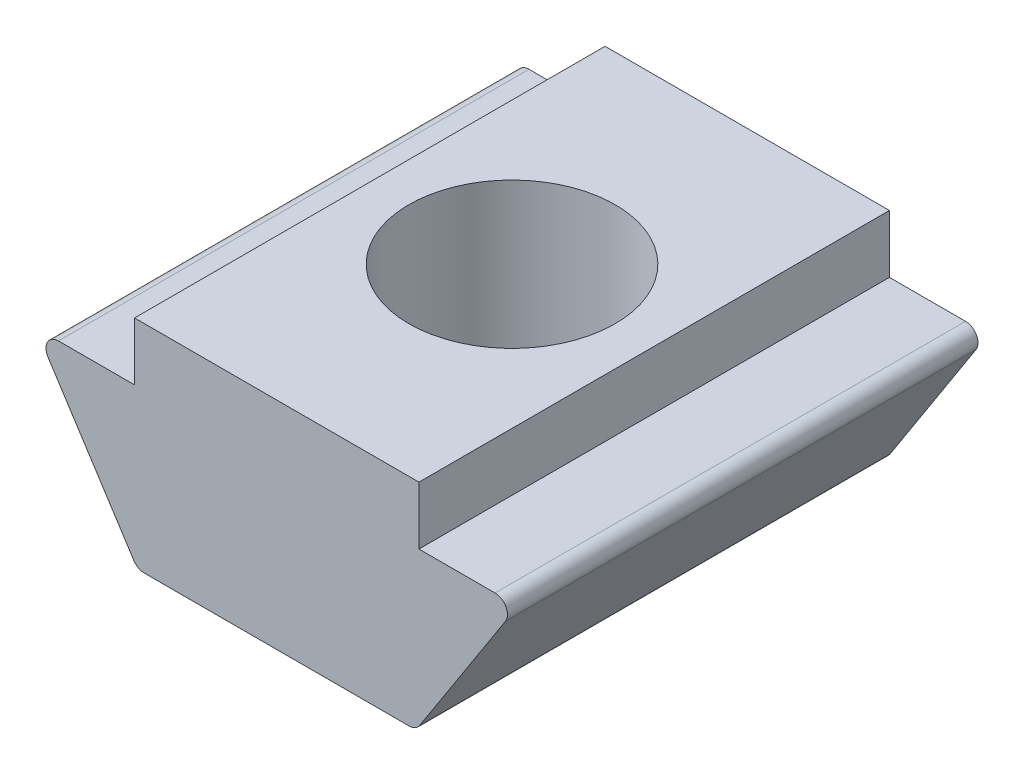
ISO-10303-21;
HEADER;
FILE_DESCRIPTION(('STEP AP214'),'2;1');
FILE_NAME('part.step','',(''),(''),'','','');
FILE_SCHEMA(('AUTOMOTIVE_DESIGN { 1 0 10303 214 1 1 1 1 }'));
ENDSEC;
DATA;
#1=APPLICATION_CONTEXT('core data for automotive mechanical design processes');
#2=APPLICATION_PROTOCOL_DEFINITION('international standard','automotive_design',2000,#1);
#3=PRODUCT_CONTEXT('',#1,'mechanical');
#4=PRODUCT('Part','Part','',(#3));
#5=PRODUCT_RELATED_PRODUCT_CATEGORY('part','',(#4));
#6=PRODUCT_DEFINITION_FORMATION('','',#4);
#7=PRODUCT_DEFINITION_CONTEXT('part definition',#1,'design');
#8=PRODUCT_DEFINITION('design','',#6,#7);
#9=PRODUCT_DEFINITION_SHAPE('','',#8);
#10=(LENGTH_UNIT() NAMED_UNIT(*) SI_UNIT(.MILLI.,.METRE.));
#11=(NAMED_UNIT(*) PLANE_ANGLE_UNIT() SI_UNIT($,.RADIAN.));
#12=(NAMED_UNIT(*) SI_UNIT($,.STERADIAN.) SOLID_ANGLE_UNIT());
#13=UNCERTAINTY_MEASURE_WITH_UNIT(LENGTH_MEASURE(1.E-05),#10,'distance_accuracy_value','');
#14=(GEOMETRIC_REPRESENTATION_CONTEXT(3) GLOBAL_UNCERTAINTY_ASSIGNED_CONTEXT((#13)) GLOBAL_UNIT_ASSIGNED_CONTEXT((#10,
#11,#12)) REPRESENTATION_CONTEXT('',''));
#15=CARTESIAN_POINT('',(0.,0.,0.));
#16=DIRECTION('',(0.,0.,1.));
#17=DIRECTION('',(1.,0.,0.));
#18=AXIS2_PLACEMENT_3D('',#15,#16,#17);
#19=CARTESIAN_POINT('',(-2.895,0.,9.58));
#20=DIRECTION('',(0.,-1.,0.));
#21=DIRECTION('',(0.,0.,-1.));
#22=AXIS2_PLACEMENT_3D('',#19,#20,#21);
#23=PLANE('',#22);
#24=DIRECTION('',(-1.,0.,0.));
#25=VECTOR('',#24,1.);
#26=CARTESIAN_POINT('',(-2.895,0.,0.));
#27=LINE('',#26,#25);
#28=CARTESIAN_POINT('',(2.895,0.,0.));
#29=VERTEX_POINT('',#28);
#30=CARTESIAN_POINT('',(-2.895,0.,0.));
#31=VERTEX_POINT('',#30);
#32=EDGE_CURVE('E226',#29,#31,#27,.T.);
#33=ORIENTED_EDGE('',*,*,#32,.T.);
#34=DIRECTION('',(0.,0.,-1.));
#35=VECTOR('',#34,1.);
#36=CARTESIAN_POINT('',(-2.895,0.,9.58));
#37=LINE('',#36,#35);
#38=CARTESIAN_POINT('',(-2.895,0.,9.58));
#39=VERTEX_POINT('',#38);
#40=EDGE_CURVE('E134',#39,#31,#37,.T.);
#41=ORIENTED_EDGE('',*,*,#40,.F.);
#42=DIRECTION('',(-1.,0.,0.));
#43=VECTOR('',#42,1.);
#44=CARTESIAN_POINT('',(-2.895,0.,9.58));
#45=LINE('',#44,#43);
#46=CARTESIAN_POINT('',(2.895,0.,9.58));
#47=VERTEX_POINT('',#46);
#48=EDGE_CURVE('E127',#47,#39,#45,.T.);
#49=ORIENTED_EDGE('',*,*,#48,.F.);
#50=DIRECTION('',(0.,0.,-1.));
#51=VECTOR('',#50,1.);
#52=CARTESIAN_POINT('',(2.895,0.,9.58));
#53=LINE('',#52,#51);
#54=EDGE_CURVE('E131',#47,#29,#53,.T.);
#55=ORIENTED_EDGE('',*,*,#54,.T.);
#56=EDGE_LOOP('',(#33,#41,#49,#55));
#57=FACE_BOUND('',#56,.T.);
#58=CARTESIAN_POINT('',(0.,0.,4.79));
#59=DIRECTION('',(0.,1.,0.));
#60=DIRECTION('',(0.,0.,1.));
#61=AXIS2_PLACEMENT_3D('',#58,#59,#60);
#62=CIRCLE('',#61,2.09999999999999);
#63=CARTESIAN_POINT('',(0.,0.,6.88999999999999));
#64=VERTEX_POINT('',#63);
#65=EDGE_CURVE('E238',#64,#64,#62,.T.);
#66=ORIENTED_EDGE('',*,*,#65,.F.);
#67=EDGE_LOOP('',(#66));
#68=FACE_BOUND('',#67,.T.);
#69=ADVANCED_FACE('F35',(#57,#68),#23,.F.);
#70=CARTESIAN_POINT('',(2.895,0.,9.58));
#71=DIRECTION('',(-1.,0.,0.));
#72=DIRECTION('',(0.,-1.,0.));
#73=AXIS2_PLACEMENT_3D('',#70,#71,#72);
#74=PLANE('',#73);
#75=DIRECTION('',(0.,1.,0.));
#76=VECTOR('',#75,1.);
#77=CARTESIAN_POINT('',(2.895,0.,0.));
#78=LINE('',#77,#76);
#79=CARTESIAN_POINT('',(2.895,-1.18,0.));
#80=VERTEX_POINT('',#79);
#81=EDGE_CURVE('E150',#80,#29,#78,.T.);
#82=ORIENTED_EDGE('',*,*,#81,.T.);
#83=ORIENTED_EDGE('',*,*,#54,.F.);
#84=DIRECTION('',(0.,1.,0.));
#85=VECTOR('',#84,1.);
#86=CARTESIAN_POINT('',(2.895,0.,9.58));
#87=LINE('',#86,#85);
#88=CARTESIAN_POINT('',(2.895,-1.18,9.58));
#89=VERTEX_POINT('',#88);
#90=EDGE_CURVE('E137',#89,#47,#87,.T.);
#91=ORIENTED_EDGE('',*,*,#90,.F.);
#92=DIRECTION('',(0.,0.,-1.));
#93=VECTOR('',#92,1.);
#94=CARTESIAN_POINT('',(2.895,-1.18,9.58));
#95=LINE('',#94,#93);
#96=EDGE_CURVE('E223',#89,#80,#95,.T.);
#97=ORIENTED_EDGE('',*,*,#96,.T.);
#98=EDGE_LOOP('',(#82,#83,#91,#97));
#99=FACE_BOUND('',#98,.T.);
#100=ADVANCED_FACE('F148',(#99),#74,.F.);
#101=CARTESIAN_POINT('',(-2.895,0.,9.58));
#102=DIRECTION('',(1.,0.,0.));
#103=DIRECTION('',(0.,1.,0.));
#104=AXIS2_PLACEMENT_3D('',#101,#102,#103);
#105=PLANE('',#104);
#106=DIRECTION('',(0.,-1.,0.));
#107=VECTOR('',#106,1.);
#108=CARTESIAN_POINT('',(-2.895,0.,0.));
#109=LINE('',#108,#107);
#110=CARTESIAN_POINT('',(-2.895,-1.18,0.));
#111=VERTEX_POINT('',#110);
#112=EDGE_CURVE('E217',#31,#111,#109,.T.);
#113=ORIENTED_EDGE('',*,*,#112,.T.);
#114=DIRECTION('',(0.,0.,-1.));
#115=VECTOR('',#114,1.);
#116=CARTESIAN_POINT('',(-2.895,-1.18,9.58));
#117=LINE('',#116,#115);
#118=CARTESIAN_POINT('',(-2.895,-1.18,9.58));
#119=VERTEX_POINT('',#118);
#120=EDGE_CURVE('E155',#119,#111,#117,.T.);
#121=ORIENTED_EDGE('',*,*,#120,.F.);
#122=DIRECTION('',(0.,-1.,0.));
#123=VECTOR('',#122,1.);
#124=CARTESIAN_POINT('',(-2.895,0.,9.58));
#125=LINE('',#124,#123);
#126=EDGE_CURVE('E136',#39,#119,#125,.T.);
#127=ORIENTED_EDGE('',*,*,#126,.F.);
#128=ORIENTED_EDGE('',*,*,#40,.T.);
#129=EDGE_LOOP('',(#113,#121,#127,#128));
#130=FACE_BOUND('',#129,.T.);
#131=ADVANCED_FACE('F261',(#130),#105,.F.);
#132=CARTESIAN_POINT('',(-2.895,-1.18,9.58));
#133=DIRECTION('',(0.,-1.,0.));
#134=DIRECTION('',(0.,0.,-1.));
#135=AXIS2_PLACEMENT_3D('',#132,#133,#134);
#136=PLANE('',#135);
#137=DIRECTION('',(-1.,0.,0.));
#138=VECTOR('',#137,1.);
#139=CARTESIAN_POINT('',(-2.895,-1.18,0.));
#140=LINE('',#139,#138);
#141=CARTESIAN_POINT('',(-4.44414909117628,-1.18,0.));
#142=VERTEX_POINT('',#141);
#143=EDGE_CURVE('E194',#111,#142,#140,.T.);
#144=ORIENTED_EDGE('',*,*,#143,.T.);
#145=DIRECTION('',(0.,0.,-1.));
#146=VECTOR('',#145,1.);
#147=CARTESIAN_POINT('',(-4.44414909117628,-1.18,9.58));
#148=LINE('',#147,#146);
#149=CARTESIAN_POINT('',(-4.44414909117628,-1.18,9.58));
#150=VERTEX_POINT('',#149);
#151=EDGE_CURVE('E44',#142,#150,#148,.F.);
#152=ORIENTED_EDGE('',*,*,#151,.T.);
#153=DIRECTION('',(-1.,0.,0.));
#154=VECTOR('',#153,1.);
#155=CARTESIAN_POINT('',(-2.895,-1.18,9.58));
#156=LINE('',#155,#154);
#157=EDGE_CURVE('E192',#119,#150,#156,.T.);
#158=ORIENTED_EDGE('',*,*,#157,.F.);
#159=ORIENTED_EDGE('',*,*,#120,.T.);
#160=EDGE_LOOP('',(#144,#152,#158,#159));
#161=FACE_BOUND('',#160,.T.);
#162=ADVANCED_FACE('F190',(#161),#136,.F.);
#163=CARTESIAN_POINT('',(-4.91,-1.18,9.58));
#164=DIRECTION('',(0.840584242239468,0.541680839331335,0.));
#165=DIRECTION('',(-0.541680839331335,0.840584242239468,0.));
#166=AXIS2_PLACEMENT_3D('',#163,#164,#165);
#167=PLANE('',#166);
#168=DIRECTION('',(0.541680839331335,-0.840584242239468,0.));
#169=VECTOR('',#168,1.);
#170=CARTESIAN_POINT('',(-4.91,-1.18,0.));
#171=LINE('',#170,#169);
#172=CARTESIAN_POINT('',(-4.6576574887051,-1.57158693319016,0.));
#173=VERTEX_POINT('',#172);
#174=CARTESIAN_POINT('',(-2.9100177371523,-4.28358693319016,0.));
#175=VERTEX_POINT('',#174);
#176=EDGE_CURVE('E207',#173,#175,#171,.T.);
#177=ORIENTED_EDGE('',*,*,#176,.T.);
#178=DIRECTION('',(0.,0.,-1.));
#179=VECTOR('',#178,1.);
#180=CARTESIAN_POINT('',(-2.9100177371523,-4.28358693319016,9.58));
#181=LINE('',#180,#179);
#182=CARTESIAN_POINT('',(-2.9100177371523,-4.28358693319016,9.58));
#183=VERTEX_POINT('',#182);
#184=EDGE_CURVE('E172',#175,#183,#181,.F.);
#185=ORIENTED_EDGE('',*,*,#184,.T.);
#186=DIRECTION('',(0.541680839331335,-0.840584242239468,0.));
#187=VECTOR('',#186,1.);
#188=CARTESIAN_POINT('',(-4.91,-1.18,9.58));
#189=LINE('',#188,#187);
#190=CARTESIAN_POINT('',(-4.6576574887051,-1.57158693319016,9.58));
#191=VERTEX_POINT('',#190);
#192=EDGE_CURVE('E199',#191,#183,#189,.T.);
#193=ORIENTED_EDGE('',*,*,#192,.F.);
#194=DIRECTION('',(0.,0.,-1.));
#195=VECTOR('',#194,1.);
#196=CARTESIAN_POINT('',(-4.6576574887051,-1.57158693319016,9.58));
#197=LINE('',#196,#195);
#198=EDGE_CURVE('E169',#191,#173,#197,.T.);
#199=ORIENTED_EDGE('',*,*,#198,.T.);
#200=EDGE_LOOP('',(#177,#185,#193,#199));
#201=FACE_BOUND('',#200,.T.);
#202=ADVANCED_FACE('F206',(#201),#167,.F.);
#203=CARTESIAN_POINT('',(-2.835,-4.4,9.58));
#204=DIRECTION('',(0.,1.,0.));
#205=DIRECTION('',(0.,0.,1.));
#206=AXIS2_PLACEMENT_3D('',#203,#204,#205);
#207=PLANE('',#206);
#208=CARTESIAN_POINT('',(0.,-4.4,4.79));
#209=DIRECTION('',(0.,1.,0.));
#210=DIRECTION('',(0.,0.,1.));
#211=AXIS2_PLACEMENT_3D('',#208,#209,#210);
#212=CIRCLE('',#211,2.09999999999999);
#213=CARTESIAN_POINT('',(0.,-4.4,6.88999999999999));
#214=VERTEX_POINT('',#213);
#215=EDGE_CURVE('E39',#214,#214,#212,.T.);
#216=ORIENTED_EDGE('',*,*,#215,.T.);
#217=EDGE_LOOP('',(#216));
#218=FACE_BOUND('',#217,.T.);
#219=DIRECTION('',(1.,0.,0.));
#220=VECTOR('',#219,1.);
#221=CARTESIAN_POINT('',(-2.835,-4.4,9.58));
#222=LINE('',#221,#220);
#223=CARTESIAN_POINT('',(-2.69650933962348,-4.4,9.58));
#224=VERTEX_POINT('',#223);
#225=CARTESIAN_POINT('',(2.69650933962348,-4.4,9.58));
#226=VERTEX_POINT('',#225);
#227=EDGE_CURVE('E233',#224,#226,#222,.T.);
#228=ORIENTED_EDGE('',*,*,#227,.F.);
#229=DIRECTION('',(0.,0.,-1.));
#230=VECTOR('',#229,1.);
#231=CARTESIAN_POINT('',(-2.69650933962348,-4.4,9.58));
#232=LINE('',#231,#230);
#233=CARTESIAN_POINT('',(-2.69650933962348,-4.4,0.));
#234=VERTEX_POINT('',#233);
#235=EDGE_CURVE('E153',#224,#234,#232,.T.);
#236=ORIENTED_EDGE('',*,*,#235,.T.);
#237=DIRECTION('',(1.,0.,0.));
#238=VECTOR('',#237,1.);
#239=CARTESIAN_POINT('',(-2.835,-4.4,0.));
#240=LINE('',#239,#238);
#241=CARTESIAN_POINT('',(2.69650933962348,-4.4,0.));
#242=VERTEX_POINT('',#241);
#243=EDGE_CURVE('E212',#234,#242,#240,.T.);
#244=ORIENTED_EDGE('',*,*,#243,.T.);
#245=DIRECTION('',(0.,0.,-1.));
#246=VECTOR('',#245,1.);
#247=CARTESIAN_POINT('',(2.69650933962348,-4.4,9.58));
#248=LINE('',#247,#246);
#249=EDGE_CURVE('E151',#242,#226,#248,.F.);
#250=ORIENTED_EDGE('',*,*,#249,.T.);
#251=EDGE_LOOP('',(#228,#236,#244,#250));
#252=FACE_BOUND('',#251,.T.);
#253=ADVANCED_FACE('F245',(#218,#252),#207,.F.);
#254=CARTESIAN_POINT('',(4.91,-1.18,9.58));
#255=DIRECTION('',(-0.840584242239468,0.541680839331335,0.));
#256=DIRECTION('',(-0.541680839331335,-0.840584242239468,0.));
#257=AXIS2_PLACEMENT_3D('',#254,#255,#256);
#258=PLANE('',#257);
#259=DIRECTION('',(0.541680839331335,0.840584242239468,0.));
#260=VECTOR('',#259,1.);
#261=CARTESIAN_POINT('',(4.91,-1.18,9.58));
#262=LINE('',#261,#260);
#263=CARTESIAN_POINT('',(2.9100177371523,-4.28358693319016,9.58));
#264=VERTEX_POINT('',#263);
#265=CARTESIAN_POINT('',(4.6576574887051,-1.57158693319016,9.58));
#266=VERTEX_POINT('',#265);
#267=EDGE_CURVE('E231',#264,#266,#262,.T.);
#268=ORIENTED_EDGE('',*,*,#267,.F.);
#269=DIRECTION('',(0.,0.,-1.));
#270=VECTOR('',#269,1.);
#271=CARTESIAN_POINT('',(2.9100177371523,-4.28358693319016,9.58));
#272=LINE('',#271,#270);
#273=CARTESIAN_POINT('',(2.9100177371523,-4.28358693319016,0.));
#274=VERTEX_POINT('',#273);
#275=EDGE_CURVE('E182',#264,#274,#272,.T.);
#276=ORIENTED_EDGE('',*,*,#275,.T.);
#277=DIRECTION('',(0.541680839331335,0.840584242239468,0.));
#278=VECTOR('',#277,1.);
#279=CARTESIAN_POINT('',(4.91,-1.18,0.));
#280=LINE('',#279,#278);
#281=CARTESIAN_POINT('',(4.6576574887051,-1.57158693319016,0.));
#282=VERTEX_POINT('',#281);
#283=EDGE_CURVE('E215',#274,#282,#280,.T.);
#284=ORIENTED_EDGE('',*,*,#283,.T.);
#285=DIRECTION('',(0.,0.,-1.));
#286=VECTOR('',#285,1.);
#287=CARTESIAN_POINT('',(4.6576574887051,-1.57158693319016,9.58));
#288=LINE('',#287,#286);
#289=EDGE_CURVE('E59',#282,#266,#288,.F.);
#290=ORIENTED_EDGE('',*,*,#289,.T.);
#291=EDGE_LOOP('',(#268,#276,#284,#290));
#292=FACE_BOUND('',#291,.T.);
#293=ADVANCED_FACE('F296',(#292),#258,.F.);
#294=CARTESIAN_POINT('',(2.895,-1.18,9.58));
#295=DIRECTION('',(0.,-1.,0.));
#296=DIRECTION('',(0.,0.,-1.));
#297=AXIS2_PLACEMENT_3D('',#294,#295,#296);
#298=PLANE('',#297);
#299=DIRECTION('',(-1.,0.,0.));
#300=VECTOR('',#299,1.);
#301=CARTESIAN_POINT('',(2.895,-1.18,9.58));
#302=LINE('',#301,#300);
#303=CARTESIAN_POINT('',(4.44414909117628,-1.18,9.58));
#304=VERTEX_POINT('',#303);
#305=EDGE_CURVE('E142',#304,#89,#302,.T.);
#306=ORIENTED_EDGE('',*,*,#305,.F.);
#307=DIRECTION('',(0.,0.,-1.));
#308=VECTOR('',#307,1.);
#309=CARTESIAN_POINT('',(4.44414909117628,-1.18,9.58));
#310=LINE('',#309,#308);
#311=CARTESIAN_POINT('',(4.44414909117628,-1.18,0.));
#312=VERTEX_POINT('',#311);
#313=EDGE_CURVE('E11',#304,#312,#310,.T.);
#314=ORIENTED_EDGE('',*,*,#313,.T.);
#315=DIRECTION('',(-1.,0.,0.));
#316=VECTOR('',#315,1.);
#317=CARTESIAN_POINT('',(2.895,-1.18,0.));
#318=LINE('',#317,#316);
#319=EDGE_CURVE('E146',#312,#80,#318,.T.);
#320=ORIENTED_EDGE('',*,*,#319,.T.);
#321=ORIENTED_EDGE('',*,*,#96,.F.);
#322=EDGE_LOOP('',(#306,#314,#320,#321));
#323=FACE_BOUND('',#322,.T.);
#324=ADVANCED_FACE('F325',(#323),#298,.F.);
#325=CARTESIAN_POINT('',(0.,0.,9.58));
#326=DIRECTION('',(0.,0.,1.));
#327=DIRECTION('',(1.,0.,0.));
#328=AXIS2_PLACEMENT_3D('',#325,#326,#327);
#329=PLANE('',#328);
#330=ORIENTED_EDGE('',*,*,#192,.T.);
#331=CARTESIAN_POINT('',(-2.69650933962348,-4.146,9.58));
#332=DIRECTION('',(0.,0.,1.));
#333=DIRECTION('',(1.,0.,0.));
#334=AXIS2_PLACEMENT_3D('',#331,#332,#333);
#335=CIRCLE('',#334,0.254);
#336=EDGE_CURVE('E179',#183,#224,#335,.T.);
#337=ORIENTED_EDGE('',*,*,#336,.T.);
#338=ORIENTED_EDGE('',*,*,#227,.T.);
#339=CARTESIAN_POINT('',(2.69650933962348,-4.146,9.58));
#340=DIRECTION('',(0.,0.,1.));
#341=DIRECTION('',(1.,0.,0.));
#342=AXIS2_PLACEMENT_3D('',#339,#340,#341);
#343=CIRCLE('',#342,0.254);
#344=EDGE_CURVE('E177',#226,#264,#343,.T.);
#345=ORIENTED_EDGE('',*,*,#344,.T.);
#346=ORIENTED_EDGE('',*,*,#267,.T.);
#347=CARTESIAN_POINT('',(4.44414909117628,-1.434,9.58));
#348=DIRECTION('',(0.,0.,1.));
#349=DIRECTION('',(1.,0.,0.));
#350=AXIS2_PLACEMENT_3D('',#347,#348,#349);
#351=CIRCLE('',#350,0.254);
#352=EDGE_CURVE('E51',#266,#304,#351,.T.);
#353=ORIENTED_EDGE('',*,*,#352,.T.);
#354=ORIENTED_EDGE('',*,*,#305,.T.);
#355=ORIENTED_EDGE('',*,*,#90,.T.);
#356=ORIENTED_EDGE('',*,*,#48,.T.);
#357=ORIENTED_EDGE('',*,*,#126,.T.);
#358=ORIENTED_EDGE('',*,*,#157,.T.);
#359=CARTESIAN_POINT('',(-4.44414909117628,-1.434,9.58));
#360=DIRECTION('',(0.,0.,1.));
#361=DIRECTION('',(1.,0.,0.));
#362=AXIS2_PLACEMENT_3D('',#359,#360,#361);
#363=CIRCLE('',#362,0.254);
#364=EDGE_CURVE('E175',#150,#191,#363,.T.);
#365=ORIENTED_EDGE('',*,*,#364,.T.);
#366=EDGE_LOOP('',(#330,#337,#338,#345,#346,#353,#354,#355,#356,#357,#358,#365));
#367=FACE_BOUND('',#366,.T.);
#368=ADVANCED_FACE('F141',(#367),#329,.T.);
#369=CARTESIAN_POINT('',(0.,0.,0.));
#370=DIRECTION('',(0.,0.,1.));
#371=DIRECTION('',(1.,0.,0.));
#372=AXIS2_PLACEMENT_3D('',#369,#370,#371);
#373=PLANE('',#372);
#374=ORIENTED_EDGE('',*,*,#243,.F.);
#375=CARTESIAN_POINT('',(-2.69650933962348,-4.146,0.));
#376=DIRECTION('',(0.,0.,1.));
#377=DIRECTION('',(1.,0.,0.));
#378=AXIS2_PLACEMENT_3D('',#375,#376,#377);
#379=CIRCLE('',#378,0.254);
#380=EDGE_CURVE('E167',#234,#175,#379,.F.);
#381=ORIENTED_EDGE('',*,*,#380,.T.);
#382=ORIENTED_EDGE('',*,*,#176,.F.);
#383=CARTESIAN_POINT('',(-4.44414909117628,-1.434,0.));
#384=DIRECTION('',(0.,0.,1.));
#385=DIRECTION('',(1.,0.,0.));
#386=AXIS2_PLACEMENT_3D('',#383,#384,#385);
#387=CIRCLE('',#386,0.254);
#388=EDGE_CURVE('E163',#173,#142,#387,.F.);
#389=ORIENTED_EDGE('',*,*,#388,.T.);
#390=ORIENTED_EDGE('',*,*,#143,.F.);
#391=ORIENTED_EDGE('',*,*,#112,.F.);
#392=ORIENTED_EDGE('',*,*,#32,.F.);
#393=ORIENTED_EDGE('',*,*,#81,.F.);
#394=ORIENTED_EDGE('',*,*,#319,.F.);
#395=CARTESIAN_POINT('',(4.44414909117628,-1.434,0.));
#396=DIRECTION('',(0.,0.,1.));
#397=DIRECTION('',(1.,0.,0.));
#398=AXIS2_PLACEMENT_3D('',#395,#396,#397);
#399=CIRCLE('',#398,0.254);
#400=EDGE_CURVE('E161',#312,#282,#399,.F.);
#401=ORIENTED_EDGE('',*,*,#400,.T.);
#402=ORIENTED_EDGE('',*,*,#283,.F.);
#403=CARTESIAN_POINT('',(2.69650933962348,-4.146,0.));
#404=DIRECTION('',(0.,0.,1.));
#405=DIRECTION('',(1.,0.,0.));
#406=AXIS2_PLACEMENT_3D('',#403,#404,#405);
#407=CIRCLE('',#406,0.254);
#408=EDGE_CURVE('E165',#274,#242,#407,.F.);
#409=ORIENTED_EDGE('',*,*,#408,.T.);
#410=EDGE_LOOP('',(#374,#381,#382,#389,#390,#391,#392,#393,#394,#401,#402,#409));
#411=FACE_BOUND('',#410,.T.);
#412=ADVANCED_FACE('F211',(#411),#373,.F.);
#413=CARTESIAN_POINT('',(-2.69650933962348,-4.146,9.58));
#414=DIRECTION('',(0.,0.,-1.));
#415=DIRECTION('',(-1.,0.,0.));
#416=AXIS2_PLACEMENT_3D('',#413,#414,#415);
#417=CYLINDRICAL_SURFACE('',#416,0.254);
#418=ORIENTED_EDGE('',*,*,#336,.F.);
#419=ORIENTED_EDGE('',*,*,#184,.F.);
#420=ORIENTED_EDGE('',*,*,#380,.F.);
#421=ORIENTED_EDGE('',*,*,#235,.F.);
#422=EDGE_LOOP('',(#418,#419,#420,#421));
#423=FACE_BOUND('',#422,.T.);
#424=ADVANCED_FACE('F266',(#423),#417,.T.);
#425=CARTESIAN_POINT('',(2.69650933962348,-4.146,9.58));
#426=DIRECTION('',(0.,0.,-1.));
#427=DIRECTION('',(-1.,0.,0.));
#428=AXIS2_PLACEMENT_3D('',#425,#426,#427);
#429=CYLINDRICAL_SURFACE('',#428,0.254);
#430=ORIENTED_EDGE('',*,*,#344,.F.);
#431=ORIENTED_EDGE('',*,*,#249,.F.);
#432=ORIENTED_EDGE('',*,*,#408,.F.);
#433=ORIENTED_EDGE('',*,*,#275,.F.);
#434=EDGE_LOOP('',(#430,#431,#432,#433));
#435=FACE_BOUND('',#434,.T.);
#436=ADVANCED_FACE('F269',(#435),#429,.T.);
#437=CARTESIAN_POINT('',(-4.44414909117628,-1.434,9.58));
#438=DIRECTION('',(0.,0.,-1.));
#439=DIRECTION('',(-1.,0.,0.));
#440=AXIS2_PLACEMENT_3D('',#437,#438,#439);
#441=CYLINDRICAL_SURFACE('',#440,0.254);
#442=ORIENTED_EDGE('',*,*,#364,.F.);
#443=ORIENTED_EDGE('',*,*,#151,.F.);
#444=ORIENTED_EDGE('',*,*,#388,.F.);
#445=ORIENTED_EDGE('',*,*,#198,.F.);
#446=EDGE_LOOP('',(#442,#443,#444,#445));
#447=FACE_BOUND('',#446,.T.);
#448=ADVANCED_FACE('F202',(#447),#441,.T.);
#449=CARTESIAN_POINT('',(4.44414909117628,-1.434,9.58));
#450=DIRECTION('',(0.,0.,-1.));
#451=DIRECTION('',(-1.,0.,0.));
#452=AXIS2_PLACEMENT_3D('',#449,#450,#451);
#453=CYLINDRICAL_SURFACE('',#452,0.254);
#454=ORIENTED_EDGE('',*,*,#352,.F.);
#455=ORIENTED_EDGE('',*,*,#289,.F.);
#456=ORIENTED_EDGE('',*,*,#400,.F.);
#457=ORIENTED_EDGE('',*,*,#313,.F.);
#458=EDGE_LOOP('',(#454,#455,#456,#457));
#459=FACE_BOUND('',#458,.T.);
#460=ADVANCED_FACE('F37',(#459),#453,.T.);
#461=CARTESIAN_POINT('',(0.,0.,4.79));
#462=DIRECTION('',(0.,1.,0.));
#463=DIRECTION('',(0.,0.,1.));
#464=AXIS2_PLACEMENT_3D('',#461,#462,#463);
#465=CYLINDRICAL_SURFACE('',#464,2.09999999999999);
#466=ORIENTED_EDGE('',*,*,#65,.T.);
#467=EDGE_LOOP('',(#466));
#468=FACE_BOUND('',#467,.T.);
#469=ORIENTED_EDGE('',*,*,#215,.F.);
#470=EDGE_LOOP('',(#469));
#471=FACE_BOUND('',#470,.T.);
#472=ADVANCED_FACE('F248',(#468,#471),#465,.F.);
#473=CLOSED_SHELL('',(#69,#100,#131,#162,#202,#253,#293,#324,#368,#412,#424,#436,#448,#460,#472));
#474=MANIFOLD_SOLID_BREP('B2',#473);
#475=ADVANCED_BREP_SHAPE_REPRESENTATION('',(#18,#474),#14);
#476=SHAPE_DEFINITION_REPRESENTATION(#9,#475);
ENDSEC;
END-ISO-10303-21;
